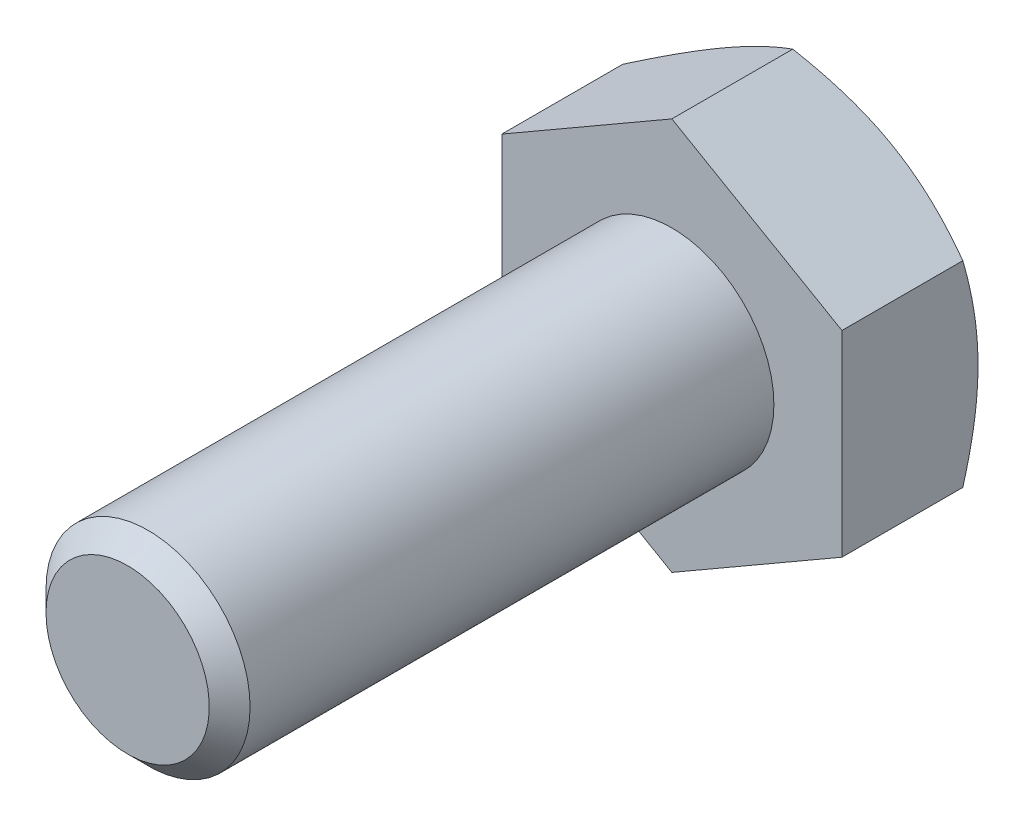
ISO-10303-21;
HEADER;
FILE_DESCRIPTION(('STEP AP214'),'2;1');
FILE_NAME('part.step','',(''),(''),'','','');
FILE_SCHEMA(('AUTOMOTIVE_DESIGN { 1 0 10303 214 1 1 1 1 }'));
ENDSEC;
DATA;
#1=APPLICATION_CONTEXT('core data for automotive mechanical design processes');
#2=APPLICATION_PROTOCOL_DEFINITION('international standard','automotive_design',2000,#1);
#3=PRODUCT_CONTEXT('',#1,'mechanical');
#4=PRODUCT('Part','Part','',(#3));
#5=PRODUCT_RELATED_PRODUCT_CATEGORY('part','',(#4));
#6=PRODUCT_DEFINITION_FORMATION('','',#4);
#7=PRODUCT_DEFINITION_CONTEXT('part definition',#1,'design');
#8=PRODUCT_DEFINITION('design','',#6,#7);
#9=PRODUCT_DEFINITION_SHAPE('','',#8);
#10=(LENGTH_UNIT() NAMED_UNIT(*) SI_UNIT(.MILLI.,.METRE.));
#11=(NAMED_UNIT(*) PLANE_ANGLE_UNIT() SI_UNIT($,.RADIAN.));
#12=(NAMED_UNIT(*) SI_UNIT($,.STERADIAN.) SOLID_ANGLE_UNIT());
#13=UNCERTAINTY_MEASURE_WITH_UNIT(LENGTH_MEASURE(1.E-05),#10,'distance_accuracy_value','');
#14=(GEOMETRIC_REPRESENTATION_CONTEXT(3) GLOBAL_UNCERTAINTY_ASSIGNED_CONTEXT((#13)) GLOBAL_UNIT_ASSIGNED_CONTEXT((#10,
#11,#12)) REPRESENTATION_CONTEXT('',''));
#15=CARTESIAN_POINT('',(0.,0.,0.));
#16=DIRECTION('',(0.,0.,1.));
#17=DIRECTION('',(1.,0.,0.));
#18=AXIS2_PLACEMENT_3D('',#15,#16,#17);
#19=CARTESIAN_POINT('',(0.,0.,16.));
#20=DIRECTION('',(0.,0.,1.));
#21=DIRECTION('',(1.,0.,0.));
#22=AXIS2_PLACEMENT_3D('',#19,#20,#21);
#23=PLANE('',#22);
#24=CARTESIAN_POINT('',(0.,0.,16.));
#25=DIRECTION('',(0.,0.,1.));
#26=DIRECTION('',(1.,0.,0.));
#27=AXIS2_PLACEMENT_3D('',#24,#25,#26);
#28=CIRCLE('',#27,2.4);
#29=CARTESIAN_POINT('',(-2.4,0.,16.));
#30=VERTEX_POINT('',#29);
#31=EDGE_CURVE('E210',#30,#30,#28,.T.);
#32=ORIENTED_EDGE('',*,*,#31,.T.);
#33=EDGE_LOOP('',(#32));
#34=FACE_BOUND('',#33,.T.);
#35=ADVANCED_FACE('F36',(#34),#23,.T.);
#36=CARTESIAN_POINT('',(0.,0.,0.));
#37=DIRECTION('',(0.,0.,1.));
#38=DIRECTION('',(1.,0.,0.));
#39=AXIS2_PLACEMENT_3D('',#36,#37,#38);
#40=CYLINDRICAL_SURFACE('',#39,3.);
#41=CARTESIAN_POINT('',(0.,0.,15.4));
#42=DIRECTION('',(0.,0.,1.));
#43=DIRECTION('',(1.,0.,0.));
#44=AXIS2_PLACEMENT_3D('',#41,#42,#43);
#45=CIRCLE('',#44,3.);
#46=CARTESIAN_POINT('',(-3.,0.,15.4));
#47=VERTEX_POINT('',#46);
#48=EDGE_CURVE('E212',#47,#47,#45,.F.);
#49=ORIENTED_EDGE('',*,*,#48,.T.);
#50=EDGE_LOOP('',(#49));
#51=FACE_BOUND('',#50,.T.);
#52=CARTESIAN_POINT('',(0.,0.,0.));
#53=DIRECTION('',(0.,0.,1.));
#54=DIRECTION('',(1.,0.,0.));
#55=AXIS2_PLACEMENT_3D('',#52,#53,#54);
#56=CIRCLE('',#55,3.);
#57=CARTESIAN_POINT('',(3.,0.,0.));
#58=VERTEX_POINT('',#57);
#59=EDGE_CURVE('E213',#58,#58,#56,.F.);
#60=ORIENTED_EDGE('',*,*,#59,.F.);
#61=EDGE_LOOP('',(#60));
#62=FACE_BOUND('',#61,.T.);
#63=ADVANCED_FACE('F201',(#51,#62),#40,.T.);
#64=CARTESIAN_POINT('',(0.,0.,16.));
#65=DIRECTION('',(0.,0.,-1.));
#66=DIRECTION('',(-1.,0.,0.));
#67=AXIS2_PLACEMENT_3D('',#64,#65,#66);
#68=CONICAL_SURFACE('',#67,2.4,0.785398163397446);
#69=CARTESIAN_POINT('',(-3.,0.,15.4));
#70=CARTESIAN_POINT('',(-2.99375,0.,15.40625));
#71=CARTESIAN_POINT('',(-2.9875,0.,15.4125));
#72=CARTESIAN_POINT('',(-2.975,0.,15.425));
#73=CARTESIAN_POINT('',(-2.96875,0.,15.43125));
#74=CARTESIAN_POINT('',(-2.95625,0.,15.44375));
#75=CARTESIAN_POINT('',(-2.95,0.,15.45));
#76=CARTESIAN_POINT('',(-2.9375,0.,15.4625));
#77=CARTESIAN_POINT('',(-2.93125,0.,15.46875));
#78=CARTESIAN_POINT('',(-2.91875,0.,15.48125));
#79=CARTESIAN_POINT('',(-2.9125,0.,15.4875));
#80=CARTESIAN_POINT('',(-2.9,0.,15.5));
#81=CARTESIAN_POINT('',(-2.89375,0.,15.50625));
#82=CARTESIAN_POINT('',(-2.88125,0.,15.51875));
#83=CARTESIAN_POINT('',(-2.875,0.,15.525));
#84=CARTESIAN_POINT('',(-2.8625,0.,15.5375));
#85=CARTESIAN_POINT('',(-2.85625,0.,15.54375));
#86=CARTESIAN_POINT('',(-2.84375,0.,15.55625));
#87=CARTESIAN_POINT('',(-2.8375,0.,15.5625));
#88=CARTESIAN_POINT('',(-2.825,0.,15.575));
#89=CARTESIAN_POINT('',(-2.81875,0.,15.58125));
#90=CARTESIAN_POINT('',(-2.80625,0.,15.59375));
#91=CARTESIAN_POINT('',(-2.8,0.,15.6));
#92=CARTESIAN_POINT('',(-2.7875,0.,15.6125));
#93=CARTESIAN_POINT('',(-2.78125,0.,15.61875));
#94=CARTESIAN_POINT('',(-2.76875,0.,15.63125));
#95=CARTESIAN_POINT('',(-2.7625,0.,15.6375));
#96=CARTESIAN_POINT('',(-2.75,0.,15.65));
#97=CARTESIAN_POINT('',(-2.74375,0.,15.65625));
#98=CARTESIAN_POINT('',(-2.73125,0.,15.66875));
#99=CARTESIAN_POINT('',(-2.725,0.,15.675));
#100=CARTESIAN_POINT('',(-2.7125,0.,15.6875));
#101=CARTESIAN_POINT('',(-2.70625,0.,15.69375));
#102=CARTESIAN_POINT('',(-2.69375,0.,15.70625));
#103=CARTESIAN_POINT('',(-2.6875,0.,15.7125));
#104=CARTESIAN_POINT('',(-2.675,0.,15.725));
#105=CARTESIAN_POINT('',(-2.66875,0.,15.73125));
#106=CARTESIAN_POINT('',(-2.65625,0.,15.74375));
#107=CARTESIAN_POINT('',(-2.65,0.,15.75));
#108=CARTESIAN_POINT('',(-2.6375,0.,15.7625));
#109=CARTESIAN_POINT('',(-2.63125,0.,15.76875));
#110=CARTESIAN_POINT('',(-2.61875,0.,15.78125));
#111=CARTESIAN_POINT('',(-2.6125,0.,15.7875));
#112=CARTESIAN_POINT('',(-2.6,0.,15.8));
#113=CARTESIAN_POINT('',(-2.59375,0.,15.80625));
#114=CARTESIAN_POINT('',(-2.58125,0.,15.81875));
#115=CARTESIAN_POINT('',(-2.575,0.,15.825));
#116=CARTESIAN_POINT('',(-2.5625,0.,15.8375));
#117=CARTESIAN_POINT('',(-2.55625,0.,15.84375));
#118=CARTESIAN_POINT('',(-2.54375,0.,15.85625));
#119=CARTESIAN_POINT('',(-2.5375,0.,15.8625));
#120=CARTESIAN_POINT('',(-2.525,0.,15.875));
#121=CARTESIAN_POINT('',(-2.51875,0.,15.88125));
#122=CARTESIAN_POINT('',(-2.50625,0.,15.89375));
#123=CARTESIAN_POINT('',(-2.5,0.,15.9));
#124=CARTESIAN_POINT('',(-2.4875,0.,15.9125));
#125=CARTESIAN_POINT('',(-2.48125,0.,15.91875));
#126=CARTESIAN_POINT('',(-2.46875,0.,15.93125));
#127=CARTESIAN_POINT('',(-2.4625,0.,15.9375));
#128=CARTESIAN_POINT('',(-2.45,0.,15.95));
#129=CARTESIAN_POINT('',(-2.44375,0.,15.95625));
#130=CARTESIAN_POINT('',(-2.43125,0.,15.96875));
#131=CARTESIAN_POINT('',(-2.425,0.,15.975));
#132=CARTESIAN_POINT('',(-2.4125,0.,15.9875));
#133=CARTESIAN_POINT('',(-2.40625,0.,15.99375));
#134=CARTESIAN_POINT('',(-2.4,0.,16.));
#135=B_SPLINE_CURVE_WITH_KNOTS('',3,(#69,#70,#71,#72,#73,#74,#75,#76,#77,#78,#79,#80,#81,#82,
#83,#84,#85,#86,#87,#88,#89,#90,#91,#92,#93,#94,#95,#96,#97,#98,#99,#100,#101,#102,#103,#104,
#105,#106,#107,#108,#109,#110,#111,#112,#113,#114,#115,#116,#117,#118,#119,#120,#121,#122,#123,
#124,#125,#126,#127,#128,#129,#130,#131,#132,#133,#134),.UNSPECIFIED.,.F.,.F.,(4,2,2,2,2,2,2,2,
2,2,2,2,2,2,2,2,2,2,2,2,2,2,2,2,2,2,2,2,2,2,2,2,4),(0.,0.0265165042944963,0.0530330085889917,
0.079549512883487,0.106066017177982,0.132582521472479,0.159099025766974,0.185615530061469,
0.212132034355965,0.238648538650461,0.265165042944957,0.291681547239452,0.318198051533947,
0.344714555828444,0.371231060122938,0.397747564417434,0.424264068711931,0.450780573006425,
0.477297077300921,0.503813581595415,0.530330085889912,0.556846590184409,0.583363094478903,
0.609879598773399,0.636396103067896,0.66291260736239,0.689429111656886,0.71594561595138,
0.742462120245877,0.768978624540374,0.795495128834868,0.822011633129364,0.848528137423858),.UNSPECIFIED.);
#136=EDGE_CURVE('BSEAM206',#47,#30,#135,.T.);
#137=ORIENTED_EDGE('',*,*,#48,.F.);
#138=ORIENTED_EDGE('',*,*,#31,.F.);
#139=ORIENTED_EDGE('',*,*,#136,.T.);
#140=ORIENTED_EDGE('',*,*,#136,.F.);
#141=EDGE_LOOP('',(#137,#139,#138,#140));
#142=FACE_BOUND('',#141,.T.);
#143=ADVANCED_FACE('F206',(#142),#68,.T.);
#144=CARTESIAN_POINT('',(0.,5.77350269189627,-4.));
#145=DIRECTION('',(0.499999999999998,0.86602540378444,0.));
#146=DIRECTION('',(-0.86602540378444,0.499999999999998,0.));
#147=AXIS2_PLACEMENT_3D('',#144,#145,#146);
#148=PLANE('',#147);
#149=CARTESIAN_POINT('',(-0.000200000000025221,5.77361816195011,-3.55335134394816));
#150=CARTESIAN_POINT('',(0.21953459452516,5.64675433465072,-3.62661343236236));
#151=CARTESIAN_POINT('',(0.441148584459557,5.51880543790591,-3.6932486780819));
#152=CARTESIAN_POINT('',(0.888213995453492,5.26069210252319,-3.80956100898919));
#153=CARTESIAN_POINT('',(1.11367335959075,5.13052307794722,-3.85919695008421));
#154=CARTESIAN_POINT('',(1.56183230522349,4.87177839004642,-3.9364489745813));
#155=CARTESIAN_POINT('',(1.78446209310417,4.74324302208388,-3.96457962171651));
#156=CARTESIAN_POINT('',(2.11918990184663,4.54998783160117,-3.98980507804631));
#157=CARTESIAN_POINT('',(2.23084219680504,4.48552534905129,-3.99538654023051));
#158=CARTESIAN_POINT('',(2.45424997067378,4.35654081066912,-4.00079778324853));
#159=CARTESIAN_POINT('',(2.5660054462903,4.29201875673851,-4.0006277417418));
#160=CARTESIAN_POINT('',(2.87218423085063,4.11524635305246,-3.99224636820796));
#161=CARTESIAN_POINT('',(3.0665060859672,4.00305457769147,-3.97817022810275));
#162=CARTESIAN_POINT('',(3.4538601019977,3.77941563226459,-3.93353474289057));
#163=CARTESIAN_POINT('',(3.64689090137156,3.6679692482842,-3.90296013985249));
#164=CARTESIAN_POINT('',(4.03502534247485,3.44387972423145,-3.82653150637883));
#165=CARTESIAN_POINT('',(4.23007999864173,3.33126486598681,-3.78035362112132));
#166=CARTESIAN_POINT('',(4.61728034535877,3.10771464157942,-3.67554820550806));
#167=CARTESIAN_POINT('',(4.80943099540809,2.99677641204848,-3.61694529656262));
#168=CARTESIAN_POINT('',(5.0002,2.8866358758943,-3.55335134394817));
#169=B_SPLINE_CURVE_WITH_KNOTS('',3,(#149,#150,#151,#152,#153,#154,#155,#156,#157,#158,#159,
#160,#161,#162,#163,#164,#165,#166,#167,#168),.UNSPECIFIED.,.F.,.F.,(4,2,2,2,2,2,2,2,2,4),(0.,
0.792555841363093,1.58701660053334,2.36181537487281,2.74884076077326,3.13585419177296,
3.8096236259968,4.48401723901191,5.17336882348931,5.86136694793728),.UNSPECIFIED.);
#170=CARTESIAN_POINT('',(0.,5.77350269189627,-3.55341801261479));
#171=VERTEX_POINT('',#170);
#172=CARTESIAN_POINT('',(2.49999999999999,4.3301270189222,-4.));
#173=VERTEX_POINT('',#172);
#174=EDGE_CURVE('E246',#171,#173,#169,.T.);
#175=ORIENTED_EDGE('',*,*,#174,.F.);
#176=DIRECTION('',(0.,0.,1.));
#177=VECTOR('',#176,1.);
#178=CARTESIAN_POINT('',(0.,5.77350269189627,-4.));
#179=LINE('',#178,#177);
#180=CARTESIAN_POINT('',(0.,5.77350269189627,0.));
#181=VERTEX_POINT('',#180);
#182=EDGE_CURVE('E220',#171,#181,#179,.T.);
#183=ORIENTED_EDGE('',*,*,#182,.T.);
#184=DIRECTION('',(-0.86602540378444,0.499999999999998,0.));
#185=VECTOR('',#184,1.);
#186=CARTESIAN_POINT('',(0.,5.77350269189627,0.));
#187=LINE('',#186,#185);
#188=CARTESIAN_POINT('',(5.,2.88675134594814,0.));
#189=VERTEX_POINT('',#188);
#190=EDGE_CURVE('E244',#189,#181,#187,.T.);
#191=ORIENTED_EDGE('',*,*,#190,.F.);
#192=DIRECTION('',(0.,0.,1.));
#193=VECTOR('',#192,1.);
#194=CARTESIAN_POINT('',(5.,2.88675134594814,-4.));
#195=LINE('',#194,#193);
#196=CARTESIAN_POINT('',(5.,2.88675134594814,-3.55341801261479));
#197=VERTEX_POINT('',#196);
#198=EDGE_CURVE('E217',#197,#189,#195,.T.);
#199=ORIENTED_EDGE('',*,*,#198,.F.);
#200=EDGE_CURVE('E176',#173,#197,#169,.T.);
#201=ORIENTED_EDGE('',*,*,#200,.F.);
#202=EDGE_LOOP('',(#175,#183,#191,#199,#201));
#203=FACE_BOUND('',#202,.T.);
#204=ADVANCED_FACE('F186',(#203),#148,.T.);
#205=CARTESIAN_POINT('',(5.,-2.88675134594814,-4.));
#206=DIRECTION('',(1.,0.,0.));
#207=DIRECTION('',(0.,0.,-1.));
#208=AXIS2_PLACEMENT_3D('',#205,#206,#207);
#209=PLANE('',#208);
#210=CARTESIAN_POINT('',(5.,-7.87365701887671,-1.5017575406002));
#211=CARTESIAN_POINT('',(5.,-7.65421637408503,-1.60868091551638));
#212=CARTESIAN_POINT('',(5.,-7.43428458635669,-1.71461296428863));
#213=CARTESIAN_POINT('',(5.,-6.99317792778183,-1.92393906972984));
#214=CARTESIAN_POINT('',(5.,-6.77200287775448,-2.02733274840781));
#215=CARTESIAN_POINT('',(5.,-6.32706593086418,-2.23152152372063));
#216=CARTESIAN_POINT('',(5.,-6.10329657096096,-2.3323004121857));
#217=CARTESIAN_POINT('',(5.,-5.65401907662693,-2.52988978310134));
#218=CARTESIAN_POINT('',(5.,-5.42851102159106,-2.62670044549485));
#219=CARTESIAN_POINT('',(5.,-4.96773019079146,-2.81850105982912));
#220=CARTESIAN_POINT('',(5.,-4.73238523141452,-2.91331851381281));
#221=CARTESIAN_POINT('',(5.,-4.2589865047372,-3.09606229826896));
#222=CARTESIAN_POINT('',(5.,-4.02093244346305,-3.18398787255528));
#223=CARTESIAN_POINT('',(5.,-3.54214478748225,-3.35072723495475));
#224=CARTESIAN_POINT('',(5.,-3.301417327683,-3.42955846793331));
#225=CARTESIAN_POINT('',(5.,-2.81651125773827,-3.57565910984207));
#226=CARTESIAN_POINT('',(5.,-2.57233372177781,-3.64293203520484));
#227=CARTESIAN_POINT('',(5.,-2.08173956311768,-3.7624103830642));
#228=CARTESIAN_POINT('',(5.,-1.83534384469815,-3.81470009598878));
#229=CARTESIAN_POINT('',(5.,-1.33936717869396,-3.90133365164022));
#230=CARTESIAN_POINT('',(5.,-1.08978658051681,-3.93567944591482));
#231=CARTESIAN_POINT('',(5.,-0.591994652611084,-3.98324171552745));
#232=CARTESIAN_POINT('',(5.,-0.343810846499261,-3.99673913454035));
#233=CARTESIAN_POINT('',(5.,0.152820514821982,-4.00220795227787));
#234=CARTESIAN_POINT('',(5.,0.401268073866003,-3.99417903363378));
#235=CARTESIAN_POINT('',(5.,0.819539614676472,-3.96311999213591));
#236=CARTESIAN_POINT('',(5.,0.989794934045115,-3.94552930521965));
#237=CARTESIAN_POINT('',(5.,1.32912938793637,-3.90127081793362));
#238=CARTESIAN_POINT('',(5.,1.4982083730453,-3.87460188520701));
#239=CARTESIAN_POINT('',(5.,2.00341173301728,-3.78237229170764));
#240=CARTESIAN_POINT('',(5.,2.33733597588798,-3.7046029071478));
#241=CARTESIAN_POINT('',(5.,2.83691487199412,-3.56883106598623));
#242=CARTESIAN_POINT('',(5.,3.00513229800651,-3.51971360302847));
#243=CARTESIAN_POINT('',(5.,3.33993504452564,-3.41615110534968));
#244=CARTESIAN_POINT('',(5.,3.50652035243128,-3.36170602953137));
#245=CARTESIAN_POINT('',(5.,3.83810926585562,-3.24838071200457));
#246=CARTESIAN_POINT('',(5.,4.00311330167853,-3.18950171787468));
#247=CARTESIAN_POINT('',(5.,4.33173746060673,-3.06802383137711));
#248=CARTESIAN_POINT('',(5.,4.49535761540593,-3.00542502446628));
#249=CARTESIAN_POINT('',(5.,4.93598294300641,-2.83201950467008));
#250=CARTESIAN_POINT('',(5.,5.21182602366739,-2.71826266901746));
#251=CARTESIAN_POINT('',(5.,5.76066658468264,-2.48405585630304));
#252=CARTESIAN_POINT('',(5.,6.03366374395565,-2.36360513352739));
#253=CARTESIAN_POINT('',(5.,6.57746623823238,-2.11759609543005));
#254=CARTESIAN_POINT('',(5.,6.84827068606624,-1.99203582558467));
#255=CARTESIAN_POINT('',(5.,7.38802449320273,-1.73703058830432));
#256=CARTESIAN_POINT('',(5.,7.65697392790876,-1.60758577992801));
#257=CARTESIAN_POINT('',(5.,8.19381940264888,-1.34544789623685));
#258=CARTESIAN_POINT('',(5.,8.46171304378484,-1.21274991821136));
#259=CARTESIAN_POINT('',(5.,8.99628800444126,-0.944933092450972));
#260=CARTESIAN_POINT('',(5.,9.2629693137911,-0.809814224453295));
#261=CARTESIAN_POINT('',(5.,10.0614145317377,-0.40162739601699));
#262=CARTESIAN_POINT('',(5.,10.5917004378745,-0.12566969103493));
#263=CARTESIAN_POINT('',(5.,11.5934978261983,0.401869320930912));
#264=CARTESIAN_POINT('',(5.,12.0652823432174,0.652934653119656));
#265=CARTESIAN_POINT('',(5.,13.0072652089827,1.15809174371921));
#266=CARTESIAN_POINT('',(5.,13.4774634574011,1.41218368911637));
#267=CARTESIAN_POINT('',(5.,14.4150598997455,1.92174727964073));
#268=CARTESIAN_POINT('',(5.,14.8824621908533,2.17721139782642));
#269=CARTESIAN_POINT('',(5.,15.8162766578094,2.68985606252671));
#270=CARTESIAN_POINT('',(5.,16.2826889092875,2.94703647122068));
#271=CARTESIAN_POINT('',(5.,16.7487534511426,3.20484156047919));
#272=B_SPLINE_CURVE_WITH_KNOTS('',3,(#210,#211,#212,#213,#214,#215,#216,#217,#218,#219,#220,
#221,#222,#223,#224,#225,#226,#227,#228,#229,#230,#231,#232,#233,#234,#235,#236,#237,#238,#239,
#240,#241,#242,#243,#244,#245,#246,#247,#248,#249,#250,#251,#252,#253,#254,#255,#256,#257,#258,
#259,#260,#261,#262,#263,#264,#265,#266,#267,#268,#269,#270,#271),.UNSPECIFIED.,.F.,.F.,(4,2,2,
2,2,2,2,2,2,2,2,2,2,2,2,2,2,2,2,2,2,2,2,2,2,2,2,2,2,2,4),(0.,0.732320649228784,1.46474969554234,
2.20096737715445,2.93715163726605,3.69825037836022,4.45943251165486,5.2191293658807,
5.97859468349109,6.73369963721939,7.48872245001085,8.23347928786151,8.97824710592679,
9.49148539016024,10.0047877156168,11.0318914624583,11.5575684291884,12.0832494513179,
12.6087831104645,13.1343047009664,14.0293094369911,14.9244140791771,15.819864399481,
16.7152781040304,17.612136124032,18.5090016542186,20.3023290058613,21.9056050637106,
23.5089806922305,25.106957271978,26.7048070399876),.UNSPECIFIED.);
#273=CARTESIAN_POINT('',(5.,0.,-4.));
#274=VERTEX_POINT('',#273);
#275=EDGE_CURVE('E174',#197,#274,#272,.F.);
#276=ORIENTED_EDGE('',*,*,#275,.F.);
#277=ORIENTED_EDGE('',*,*,#198,.T.);
#278=DIRECTION('',(0.,1.,0.));
#279=VECTOR('',#278,1.);
#280=CARTESIAN_POINT('',(5.,-2.88675134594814,0.));
#281=LINE('',#280,#279);
#282=CARTESIAN_POINT('',(5.,-2.88675134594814,0.));
#283=VERTEX_POINT('',#282);
#284=EDGE_CURVE('E222',#283,#189,#281,.T.);
#285=ORIENTED_EDGE('',*,*,#284,.F.);
#286=DIRECTION('',(0.,0.,1.));
#287=VECTOR('',#286,1.);
#288=CARTESIAN_POINT('',(5.,-2.88675134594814,-4.));
#289=LINE('',#288,#287);
#290=CARTESIAN_POINT('',(5.,-2.88675134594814,-3.55341801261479));
#291=VERTEX_POINT('',#290);
#292=EDGE_CURVE('E228',#291,#283,#289,.T.);
#293=ORIENTED_EDGE('',*,*,#292,.F.);
#294=EDGE_CURVE('E169',#274,#291,#272,.F.);
#295=ORIENTED_EDGE('',*,*,#294,.F.);
#296=EDGE_LOOP('',(#276,#277,#285,#293,#295));
#297=FACE_BOUND('',#296,.T.);
#298=ADVANCED_FACE('F182',(#297),#209,.T.);
#299=CARTESIAN_POINT('',(0.,-5.77350269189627,-4.));
#300=DIRECTION('',(0.499999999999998,-0.86602540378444,0.));
#301=DIRECTION('',(0.86602540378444,0.499999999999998,0.));
#302=AXIS2_PLACEMENT_3D('',#299,#300,#301);
#303=PLANE('',#302);
#304=CARTESIAN_POINT('',(5.0002,-2.8866358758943,-3.55335134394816));
#305=CARTESIAN_POINT('',(4.78046540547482,-3.01349970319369,-3.62661343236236));
#306=CARTESIAN_POINT('',(4.55885141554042,-3.1414485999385,-3.6932486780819));
#307=CARTESIAN_POINT('',(4.11178600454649,-3.39956193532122,-3.80956100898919));
#308=CARTESIAN_POINT('',(3.88632664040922,-3.52973095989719,-3.85919695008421));
#309=CARTESIAN_POINT('',(3.43816769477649,-3.78847564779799,-3.9364489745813));
#310=CARTESIAN_POINT('',(3.2155379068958,-3.91701101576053,-3.96457962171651));
#311=CARTESIAN_POINT('',(2.88081009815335,-4.11026620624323,-3.98980507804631));
#312=CARTESIAN_POINT('',(2.76915780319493,-4.17472868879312,-3.99538654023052));
#313=CARTESIAN_POINT('',(2.54575002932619,-4.30371322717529,-4.00079778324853));
#314=CARTESIAN_POINT('',(2.43399455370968,-4.3682352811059,-4.0006277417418));
#315=CARTESIAN_POINT('',(2.12781576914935,-4.54500768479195,-3.99224636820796));
#316=CARTESIAN_POINT('',(1.93349391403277,-4.65719946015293,-3.97817022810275));
#317=CARTESIAN_POINT('',(1.54613989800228,-4.88083840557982,-3.93353474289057));
#318=CARTESIAN_POINT('',(1.35310909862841,-4.99228478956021,-3.90296013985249));
#319=CARTESIAN_POINT('',(0.964974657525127,-5.21637431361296,-3.82653150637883));
#320=CARTESIAN_POINT('',(0.769920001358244,-5.3289891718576,-3.78035362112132));
#321=CARTESIAN_POINT('',(0.382719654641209,-5.55253939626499,-3.67554820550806));
#322=CARTESIAN_POINT('',(0.19056900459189,-5.66347762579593,-3.61694529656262));
#323=CARTESIAN_POINT('',(-0.000200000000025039,-5.77361816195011,-3.55335134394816));
#324=B_SPLINE_CURVE_WITH_KNOTS('',3,(#304,#305,#306,#307,#308,#309,#310,#311,#312,#313,#314,
#315,#316,#317,#318,#319,#320,#321,#322,#323),.UNSPECIFIED.,.F.,.F.,(4,2,2,2,2,2,2,2,2,4),(0.,
0.792555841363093,1.58701660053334,2.36181537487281,2.74884076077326,3.13585419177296,
3.80962362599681,4.48401723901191,5.17336882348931,5.86136694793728),.UNSPECIFIED.);
#325=CARTESIAN_POINT('',(2.49999999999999,-4.3301270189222,-4.));
#326=VERTEX_POINT('',#325);
#327=EDGE_CURVE('E175',#291,#326,#324,.T.);
#328=ORIENTED_EDGE('',*,*,#327,.F.);
#329=ORIENTED_EDGE('',*,*,#292,.T.);
#330=DIRECTION('',(0.86602540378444,0.499999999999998,0.));
#331=VECTOR('',#330,1.);
#332=CARTESIAN_POINT('',(0.,-5.77350269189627,0.));
#333=LINE('',#332,#331);
#334=CARTESIAN_POINT('',(0.,-5.77350269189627,0.));
#335=VERTEX_POINT('',#334);
#336=EDGE_CURVE('E233',#335,#283,#333,.T.);
#337=ORIENTED_EDGE('',*,*,#336,.F.);
#338=DIRECTION('',(0.,0.,1.));
#339=VECTOR('',#338,1.);
#340=CARTESIAN_POINT('',(0.,-5.77350269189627,-4.));
#341=LINE('',#340,#339);
#342=CARTESIAN_POINT('',(0.,-5.77350269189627,-3.55341801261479));
#343=VERTEX_POINT('',#342);
#344=EDGE_CURVE('E226',#343,#335,#341,.T.);
#345=ORIENTED_EDGE('',*,*,#344,.F.);
#346=EDGE_CURVE('E163',#326,#343,#324,.T.);
#347=ORIENTED_EDGE('',*,*,#346,.F.);
#348=EDGE_LOOP('',(#328,#329,#337,#345,#347));
#349=FACE_BOUND('',#348,.T.);
#350=ADVANCED_FACE('F185',(#349),#303,.T.);
#351=CARTESIAN_POINT('',(0.,-5.77350269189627,-4.));
#352=DIRECTION('',(-0.500000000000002,-0.866025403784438,0.));
#353=DIRECTION('',(0.866025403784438,-0.500000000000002,0.));
#354=AXIS2_PLACEMENT_3D('',#351,#352,#353);
#355=PLANE('',#354);
#356=CARTESIAN_POINT('',(0.000199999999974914,-5.77361816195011,-3.55335134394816));
#357=CARTESIAN_POINT('',(-0.219534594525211,-5.64675433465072,-3.62661343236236));
#358=CARTESIAN_POINT('',(-0.441148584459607,-5.5188054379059,-3.6932486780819));
#359=CARTESIAN_POINT('',(-0.88821399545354,-5.26069210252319,-3.80956100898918));
#360=CARTESIAN_POINT('',(-1.1136733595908,-5.13052307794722,-3.85919695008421));
#361=CARTESIAN_POINT('',(-1.56183230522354,-4.87177839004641,-3.9364489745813));
#362=CARTESIAN_POINT('',(-1.78446209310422,-4.74324302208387,-3.96457962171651));
#363=CARTESIAN_POINT('',(-2.11918990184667,-4.54998783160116,-3.98980507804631));
#364=CARTESIAN_POINT('',(-2.23084219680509,-4.48552534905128,-3.99538654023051));
#365=CARTESIAN_POINT('',(-2.45424997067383,-4.35654081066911,-4.00079778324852));
#366=CARTESIAN_POINT('',(-2.56600544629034,-4.2920187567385,-4.00062774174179));
#367=CARTESIAN_POINT('',(-2.87218423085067,-4.11524635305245,-3.99224636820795));
#368=CARTESIAN_POINT('',(-3.06650608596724,-4.00305457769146,-3.97817022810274));
#369=CARTESIAN_POINT('',(-3.45386010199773,-3.77941563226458,-3.93353474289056));
#370=CARTESIAN_POINT('',(-3.64689090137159,-3.66796924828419,-3.90296013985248));
#371=CARTESIAN_POINT('',(-4.03502534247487,-3.44387972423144,-3.82653150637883));
#372=CARTESIAN_POINT('',(-4.23007999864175,-3.33126486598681,-3.78035362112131));
#373=CARTESIAN_POINT('',(-4.61728034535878,-3.10771464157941,-3.67554820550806));
#374=CARTESIAN_POINT('',(-4.80943099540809,-2.99677641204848,-3.61694529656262));
#375=CARTESIAN_POINT('',(-5.0002,-2.8866358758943,-3.55335134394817));
#376=B_SPLINE_CURVE_WITH_KNOTS('',3,(#356,#357,#358,#359,#360,#361,#362,#363,#364,#365,#366,
#367,#368,#369,#370,#371,#372,#373,#374,#375),.UNSPECIFIED.,.F.,.F.,(4,2,2,2,2,2,2,2,2,4),(0.,
0.792555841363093,1.58701660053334,2.36181537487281,2.74884076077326,3.13585419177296,
3.80962362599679,4.48401723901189,5.17336882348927,5.86136694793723),.UNSPECIFIED.);
#377=CARTESIAN_POINT('',(-2.50000000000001,-4.33012701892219,-4.));
#378=VERTEX_POINT('',#377);
#379=EDGE_CURVE('E265',#343,#378,#376,.T.);
#380=ORIENTED_EDGE('',*,*,#379,.F.);
#381=ORIENTED_EDGE('',*,*,#344,.T.);
#382=DIRECTION('',(0.866025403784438,-0.500000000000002,0.));
#383=VECTOR('',#382,1.);
#384=CARTESIAN_POINT('',(0.,-5.77350269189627,0.));
#385=LINE('',#384,#383);
#386=CARTESIAN_POINT('',(-5.,-2.88675134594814,0.));
#387=VERTEX_POINT('',#386);
#388=EDGE_CURVE('E236',#387,#335,#385,.T.);
#389=ORIENTED_EDGE('',*,*,#388,.F.);
#390=DIRECTION('',(0.,0.,1.));
#391=VECTOR('',#390,1.);
#392=CARTESIAN_POINT('',(-5.,-2.88675134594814,-4.));
#393=LINE('',#392,#391);
#394=CARTESIAN_POINT('',(-5.,-2.88675134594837,-3.55341801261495));
#395=VERTEX_POINT('',#394);
#396=EDGE_CURVE('E224',#395,#387,#393,.T.);
#397=ORIENTED_EDGE('',*,*,#396,.F.);
#398=EDGE_CURVE('E112',#378,#395,#376,.T.);
#399=ORIENTED_EDGE('',*,*,#398,.F.);
#400=EDGE_LOOP('',(#380,#381,#389,#397,#399));
#401=FACE_BOUND('',#400,.T.);
#402=ADVANCED_FACE('F190',(#401),#355,.T.);
#403=CARTESIAN_POINT('',(-5.,-2.88675134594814,-4.));
#404=DIRECTION('',(-1.,0.,0.));
#405=DIRECTION('',(0.,0.,1.));
#406=AXIS2_PLACEMENT_3D('',#403,#404,#405);
#407=PLANE('',#406);
#408=CARTESIAN_POINT('',(-5.,-7.87365701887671,-1.5017575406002));
#409=CARTESIAN_POINT('',(-5.,-7.65421637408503,-1.60868091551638));
#410=CARTESIAN_POINT('',(-5.,-7.43428458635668,-1.71461296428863));
#411=CARTESIAN_POINT('',(-5.,-6.99317792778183,-1.92393906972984));
#412=CARTESIAN_POINT('',(-5.,-6.77200287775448,-2.02733274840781));
#413=CARTESIAN_POINT('',(-5.,-6.32706593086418,-2.23152152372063));
#414=CARTESIAN_POINT('',(-5.,-6.10329657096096,-2.3323004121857));
#415=CARTESIAN_POINT('',(-5.,-5.65401907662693,-2.52988978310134));
#416=CARTESIAN_POINT('',(-5.,-5.42851102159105,-2.62670044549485));
#417=CARTESIAN_POINT('',(-5.,-4.96773019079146,-2.81850105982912));
#418=CARTESIAN_POINT('',(-5.,-4.73238523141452,-2.91331851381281));
#419=CARTESIAN_POINT('',(-5.,-4.2589865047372,-3.09606229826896));
#420=CARTESIAN_POINT('',(-5.,-4.02093244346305,-3.18398787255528));
#421=CARTESIAN_POINT('',(-5.,-3.54214478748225,-3.35072723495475));
#422=CARTESIAN_POINT('',(-5.,-3.301417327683,-3.42955846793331));
#423=CARTESIAN_POINT('',(-5.,-2.81651125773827,-3.57565910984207));
#424=CARTESIAN_POINT('',(-5.,-2.57233372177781,-3.64293203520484));
#425=CARTESIAN_POINT('',(-5.,-2.08173956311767,-3.7624103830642));
#426=CARTESIAN_POINT('',(-5.,-1.83534384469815,-3.81470009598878));
#427=CARTESIAN_POINT('',(-5.,-1.33936717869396,-3.90133365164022));
#428=CARTESIAN_POINT('',(-5.,-1.08978658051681,-3.93567944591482));
#429=CARTESIAN_POINT('',(-5.,-0.591994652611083,-3.98324171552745));
#430=CARTESIAN_POINT('',(-5.,-0.343810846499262,-3.99673913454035));
#431=CARTESIAN_POINT('',(-5.,0.152820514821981,-4.00220795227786));
#432=CARTESIAN_POINT('',(-5.,0.401268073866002,-3.99417903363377));
#433=CARTESIAN_POINT('',(-5.,0.819539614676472,-3.96311999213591));
#434=CARTESIAN_POINT('',(-5.,0.989794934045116,-3.94552930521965));
#435=CARTESIAN_POINT('',(-5.,1.32912938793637,-3.90127081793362));
#436=CARTESIAN_POINT('',(-5.,1.4982083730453,-3.87460188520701));
#437=CARTESIAN_POINT('',(-5.,2.00341173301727,-3.78237229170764));
#438=CARTESIAN_POINT('',(-5.,2.33733597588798,-3.7046029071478));
#439=CARTESIAN_POINT('',(-5.,2.83691487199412,-3.56883106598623));
#440=CARTESIAN_POINT('',(-5.,3.00513229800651,-3.51971360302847));
#441=CARTESIAN_POINT('',(-5.,3.33993504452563,-3.41615110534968));
#442=CARTESIAN_POINT('',(-5.,3.50652035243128,-3.36170602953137));
#443=CARTESIAN_POINT('',(-5.,3.83810926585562,-3.24838071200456));
#444=CARTESIAN_POINT('',(-5.,4.00311330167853,-3.18950171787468));
#445=CARTESIAN_POINT('',(-5.,4.33173746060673,-3.06802383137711));
#446=CARTESIAN_POINT('',(-5.,4.49535761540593,-3.00542502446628));
#447=CARTESIAN_POINT('',(-5.,4.93598294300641,-2.83201950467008));
#448=CARTESIAN_POINT('',(-5.,5.21182602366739,-2.71826266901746));
#449=CARTESIAN_POINT('',(-5.,5.76066658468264,-2.48405585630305));
#450=CARTESIAN_POINT('',(-5.,6.03366374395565,-2.36360513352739));
#451=CARTESIAN_POINT('',(-5.,6.57746623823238,-2.11759609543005));
#452=CARTESIAN_POINT('',(-5.,6.84827068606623,-1.99203582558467));
#453=CARTESIAN_POINT('',(-5.,7.38802449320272,-1.73703058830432));
#454=CARTESIAN_POINT('',(-5.,7.65697392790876,-1.60758577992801));
#455=CARTESIAN_POINT('',(-5.,8.19381940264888,-1.34544789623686));
#456=CARTESIAN_POINT('',(-5.,8.46171304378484,-1.21274991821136));
#457=CARTESIAN_POINT('',(-5.,8.99628800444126,-0.944933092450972));
#458=CARTESIAN_POINT('',(-5.,9.26296931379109,-0.809814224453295));
#459=CARTESIAN_POINT('',(-5.,10.0614145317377,-0.40162739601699));
#460=CARTESIAN_POINT('',(-5.,10.5917004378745,-0.125669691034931));
#461=CARTESIAN_POINT('',(-5.,11.5934978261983,0.40186932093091));
#462=CARTESIAN_POINT('',(-5.,12.0652823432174,0.652934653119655));
#463=CARTESIAN_POINT('',(-5.,13.0072652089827,1.15809174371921));
#464=CARTESIAN_POINT('',(-5.,13.4774634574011,1.41218368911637));
#465=CARTESIAN_POINT('',(-5.,14.4150598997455,1.92174727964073));
#466=CARTESIAN_POINT('',(-5.,14.8824621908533,2.17721139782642));
#467=CARTESIAN_POINT('',(-5.,15.8162766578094,2.68985606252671));
#468=CARTESIAN_POINT('',(-5.,16.2826889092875,2.94703647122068));
#469=CARTESIAN_POINT('',(-5.,16.7487534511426,3.20484156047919));
#470=B_SPLINE_CURVE_WITH_KNOTS('',3,(#408,#409,#410,#411,#412,#413,#414,#415,#416,#417,#418,
#419,#420,#421,#422,#423,#424,#425,#426,#427,#428,#429,#430,#431,#432,#433,#434,#435,#436,#437,
#438,#439,#440,#441,#442,#443,#444,#445,#446,#447,#448,#449,#450,#451,#452,#453,#454,#455,#456,
#457,#458,#459,#460,#461,#462,#463,#464,#465,#466,#467,#468,#469),.UNSPECIFIED.,.F.,.F.,(4,2,2,
2,2,2,2,2,2,2,2,2,2,2,2,2,2,2,2,2,2,2,2,2,2,2,2,2,2,2,4),(0.,0.732320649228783,1.46474969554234,
2.20096737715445,2.93715163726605,3.69825037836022,4.45943251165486,5.2191293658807,
5.97859468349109,6.7336996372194,7.48872245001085,8.23347928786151,8.97824710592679,
9.49148539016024,10.0047877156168,11.0318914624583,11.5575684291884,12.0832494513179,
12.6087831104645,13.1343047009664,14.0293094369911,14.9244140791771,15.819864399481,
16.7152781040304,17.612136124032,18.5090016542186,20.3023290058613,21.9056050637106,
23.5089806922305,25.106957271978,26.7048070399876),.UNSPECIFIED.);
#471=CARTESIAN_POINT('',(-5.,0.,-4.));
#472=VERTEX_POINT('',#471);
#473=EDGE_CURVE('E107',#395,#472,#470,.T.);
#474=ORIENTED_EDGE('',*,*,#473,.F.);
#475=ORIENTED_EDGE('',*,*,#396,.T.);
#476=DIRECTION('',(0.,-1.,0.));
#477=VECTOR('',#476,1.);
#478=CARTESIAN_POINT('',(-5.,-2.88675134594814,0.));
#479=LINE('',#478,#477);
#480=CARTESIAN_POINT('',(-5.,2.88675134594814,0.));
#481=VERTEX_POINT('',#480);
#482=EDGE_CURVE('E239',#481,#387,#479,.T.);
#483=ORIENTED_EDGE('',*,*,#482,.F.);
#484=DIRECTION('',(0.,0.,1.));
#485=VECTOR('',#484,1.);
#486=CARTESIAN_POINT('',(-5.,2.88675134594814,-4.));
#487=LINE('',#486,#485);
#488=CARTESIAN_POINT('',(-5.,2.88675134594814,-3.55341801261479));
#489=VERTEX_POINT('',#488);
#490=EDGE_CURVE('E133',#489,#481,#487,.T.);
#491=ORIENTED_EDGE('',*,*,#490,.F.);
#492=EDGE_CURVE('E116',#472,#489,#470,.T.);
#493=ORIENTED_EDGE('',*,*,#492,.F.);
#494=EDGE_LOOP('',(#474,#475,#483,#491,#493));
#495=FACE_BOUND('',#494,.T.);
#496=ADVANCED_FACE('F131',(#495),#407,.T.);
#497=CARTESIAN_POINT('',(-5.,2.88675134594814,-4.));
#498=DIRECTION('',(-0.500000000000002,0.866025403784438,0.));
#499=DIRECTION('',(-0.866025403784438,-0.500000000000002,0.));
#500=AXIS2_PLACEMENT_3D('',#497,#498,#499);
#501=PLANE('',#500);
#502=CARTESIAN_POINT('',(-5.0002,2.8866358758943,-3.55335134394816));
#503=CARTESIAN_POINT('',(-4.78046540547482,3.01349970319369,-3.62661343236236));
#504=CARTESIAN_POINT('',(-4.55885141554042,3.1414485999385,-3.6932486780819));
#505=CARTESIAN_POINT('',(-4.11178600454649,3.39956193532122,-3.80956100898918));
#506=CARTESIAN_POINT('',(-3.88632664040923,3.52973095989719,-3.85919695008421));
#507=CARTESIAN_POINT('',(-3.43816769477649,3.78847564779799,-3.9364489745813));
#508=CARTESIAN_POINT('',(-3.21553790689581,3.91701101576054,-3.96457962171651));
#509=CARTESIAN_POINT('',(-2.88081009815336,4.11026620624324,-3.98980507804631));
#510=CARTESIAN_POINT('',(-2.76915780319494,4.17472868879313,-3.99538654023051));
#511=CARTESIAN_POINT('',(-2.5457500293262,4.3037132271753,-4.00079778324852));
#512=CARTESIAN_POINT('',(-2.43399455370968,4.36823528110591,-4.00062774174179));
#513=CARTESIAN_POINT('',(-2.12781576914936,4.54500768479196,-3.99224636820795));
#514=CARTESIAN_POINT('',(-1.93349391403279,4.65719946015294,-3.97817022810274));
#515=CARTESIAN_POINT('',(-1.5461398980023,4.88083840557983,-3.93353474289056));
#516=CARTESIAN_POINT('',(-1.35310909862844,4.99228478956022,-3.90296013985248));
#517=CARTESIAN_POINT('',(-0.96497465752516,5.21637431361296,-3.82653150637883));
#518=CARTESIAN_POINT('',(-0.769920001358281,5.3289891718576,-3.78035362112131));
#519=CARTESIAN_POINT('',(-0.382719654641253,5.55253939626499,-3.67554820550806));
#520=CARTESIAN_POINT('',(-0.190569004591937,5.66347762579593,-3.61694529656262));
#521=CARTESIAN_POINT('',(0.000199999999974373,5.7736181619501,-3.55335134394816));
#522=B_SPLINE_CURVE_WITH_KNOTS('',3,(#502,#503,#504,#505,#506,#507,#508,#509,#510,#511,#512,
#513,#514,#515,#516,#517,#518,#519,#520,#521),.UNSPECIFIED.,.F.,.F.,(4,2,2,2,2,2,2,2,2,4),(0.,
0.792555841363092,1.58701660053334,2.36181537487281,2.74884076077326,3.13585419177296,
3.80962362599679,4.48401723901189,5.17336882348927,5.86136694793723),.UNSPECIFIED.);
#523=CARTESIAN_POINT('',(-2.50000000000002,4.3301270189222,-4.));
#524=VERTEX_POINT('',#523);
#525=EDGE_CURVE('E122',#489,#524,#522,.T.);
#526=ORIENTED_EDGE('',*,*,#525,.F.);
#527=ORIENTED_EDGE('',*,*,#490,.T.);
#528=DIRECTION('',(-0.866025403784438,-0.500000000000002,0.));
#529=VECTOR('',#528,1.);
#530=CARTESIAN_POINT('',(-5.,2.88675134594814,0.));
#531=LINE('',#530,#529);
#532=EDGE_CURVE('E242',#181,#481,#531,.T.);
#533=ORIENTED_EDGE('',*,*,#532,.F.);
#534=ORIENTED_EDGE('',*,*,#182,.F.);
#535=EDGE_CURVE('E124',#524,#171,#522,.T.);
#536=ORIENTED_EDGE('',*,*,#535,.F.);
#537=EDGE_LOOP('',(#526,#527,#533,#534,#536));
#538=FACE_BOUND('',#537,.T.);
#539=ADVANCED_FACE('F198',(#538),#501,.T.);
#540=CARTESIAN_POINT('',(5.,2.88675134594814,0.));
#541=DIRECTION('',(0.,0.,1.));
#542=DIRECTION('',(1.,0.,0.));
#543=AXIS2_PLACEMENT_3D('',#540,#541,#542);
#544=PLANE('',#543);
#545=ORIENTED_EDGE('',*,*,#59,.T.);
#546=EDGE_LOOP('',(#545));
#547=FACE_BOUND('',#546,.T.);
#548=ORIENTED_EDGE('',*,*,#190,.T.);
#549=ORIENTED_EDGE('',*,*,#532,.T.);
#550=ORIENTED_EDGE('',*,*,#482,.T.);
#551=ORIENTED_EDGE('',*,*,#388,.T.);
#552=ORIENTED_EDGE('',*,*,#336,.T.);
#553=ORIENTED_EDGE('',*,*,#284,.T.);
#554=EDGE_LOOP('',(#548,#549,#550,#551,#552,#553));
#555=FACE_BOUND('',#554,.T.);
#556=ADVANCED_FACE('F155',(#547,#555),#544,.T.);
#557=CARTESIAN_POINT('',(0.,0.,0.));
#558=DIRECTION('',(0.,0.,1.));
#559=DIRECTION('',(1.,0.,0.));
#560=AXIS2_PLACEMENT_3D('',#557,#558,#559);
#561=CONICAL_SURFACE('',#560,11.9282032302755,1.0471975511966);
#562=ORIENTED_EDGE('',*,*,#200,.T.);
#563=ORIENTED_EDGE('',*,*,#275,.T.);
#564=CARTESIAN_POINT('',(0.,0.,-4.));
#565=DIRECTION('',(0.,0.,1.));
#566=DIRECTION('',(1.,0.,0.));
#567=AXIS2_PLACEMENT_3D('',#564,#565,#566);
#568=CIRCLE('',#567,5.);
#569=EDGE_CURVE('E39',#173,#274,#568,.F.);
#570=ORIENTED_EDGE('',*,*,#569,.F.);
#571=EDGE_LOOP('',(#562,#563,#570));
#572=FACE_BOUND('',#571,.T.);
#573=ADVANCED_FACE('F255',(#572),#561,.T.);
#574=ORIENTED_EDGE('',*,*,#174,.T.);
#575=EDGE_CURVE('E129',#524,#173,#568,.F.);
#576=ORIENTED_EDGE('',*,*,#575,.F.);
#577=ORIENTED_EDGE('',*,*,#535,.T.);
#578=EDGE_LOOP('',(#574,#576,#577));
#579=FACE_BOUND('',#578,.T.);
#580=ADVANCED_FACE('F154',(#579),#561,.T.);
#581=ORIENTED_EDGE('',*,*,#492,.T.);
#582=ORIENTED_EDGE('',*,*,#525,.T.);
#583=CARTESIAN_POINT('',(0.,0.,-4.));
#584=DIRECTION('',(0.,0.,-1.));
#585=DIRECTION('',(-1.,0.,0.));
#586=AXIS2_PLACEMENT_3D('',#583,#584,#585);
#587=CIRCLE('',#586,5.);
#588=EDGE_CURVE('E57',#472,#524,#587,.T.);
#589=ORIENTED_EDGE('',*,*,#588,.F.);
#590=EDGE_LOOP('',(#581,#582,#589));
#591=FACE_BOUND('',#590,.T.);
#592=ADVANCED_FACE('F120',(#591),#561,.T.);
#593=ORIENTED_EDGE('',*,*,#398,.T.);
#594=ORIENTED_EDGE('',*,*,#473,.T.);
#595=EDGE_CURVE('E109',#378,#472,#568,.F.);
#596=ORIENTED_EDGE('',*,*,#595,.F.);
#597=EDGE_LOOP('',(#593,#594,#596));
#598=FACE_BOUND('',#597,.T.);
#599=ADVANCED_FACE('F108',(#598),#561,.T.);
#600=ORIENTED_EDGE('',*,*,#346,.T.);
#601=ORIENTED_EDGE('',*,*,#379,.T.);
#602=EDGE_CURVE('E44',#326,#378,#568,.F.);
#603=ORIENTED_EDGE('',*,*,#602,.F.);
#604=EDGE_LOOP('',(#600,#601,#603));
#605=FACE_BOUND('',#604,.T.);
#606=ADVANCED_FACE('F267',(#605),#561,.T.);
#607=ORIENTED_EDGE('',*,*,#294,.T.);
#608=ORIENTED_EDGE('',*,*,#327,.T.);
#609=EDGE_CURVE('E11',#274,#326,#568,.F.);
#610=ORIENTED_EDGE('',*,*,#609,.F.);
#611=EDGE_LOOP('',(#607,#608,#610));
#612=FACE_BOUND('',#611,.T.);
#613=ADVANCED_FACE('F262',(#612),#561,.T.);
#614=CARTESIAN_POINT('',(5.,2.88675134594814,-4.));
#615=DIRECTION('',(0.,0.,1.));
#616=DIRECTION('',(1.,0.,0.));
#617=AXIS2_PLACEMENT_3D('',#614,#615,#616);
#618=PLANE('',#617);
#619=ORIENTED_EDGE('',*,*,#569,.T.);
#620=ORIENTED_EDGE('',*,*,#609,.T.);
#621=ORIENTED_EDGE('',*,*,#602,.T.);
#622=ORIENTED_EDGE('',*,*,#595,.T.);
#623=ORIENTED_EDGE('',*,*,#588,.T.);
#624=ORIENTED_EDGE('',*,*,#575,.T.);
#625=EDGE_LOOP('',(#619,#620,#621,#622,#623,#624));
#626=FACE_BOUND('',#625,.T.);
#627=ADVANCED_FACE('F127',(#626),#618,.F.);
#628=CLOSED_SHELL('',(#35,#63,#143,#204,#298,#350,#402,#496,#539,#556,#573,#580,#592,#599,#606,
#613,#627));
#629=MANIFOLD_SOLID_BREP('B2',#628);
#630=ADVANCED_BREP_SHAPE_REPRESENTATION('',(#18,#629),#14);
#631=SHAPE_DEFINITION_REPRESENTATION(#9,#630);
ENDSEC;
END-ISO-10303-21;
